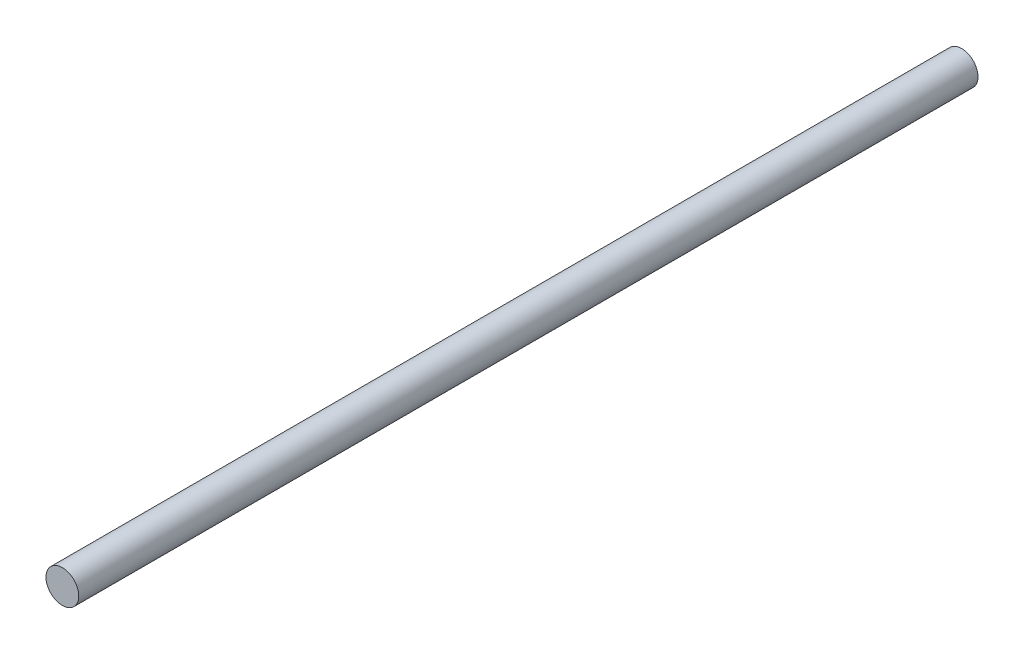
ISO-10303-21;
HEADER;
FILE_DESCRIPTION(('STEP AP214'),'2;1');
FILE_NAME('part.step','',(''),(''),'','','');
FILE_SCHEMA(('AUTOMOTIVE_DESIGN { 1 0 10303 214 1 1 1 1 }'));
ENDSEC;
DATA;
#1=APPLICATION_CONTEXT('core data for automotive mechanical design processes');
#2=APPLICATION_PROTOCOL_DEFINITION('international standard','automotive_design',2000,#1);
#3=PRODUCT_CONTEXT('',#1,'mechanical');
#4=PRODUCT('Part','Part','',(#3));
#5=PRODUCT_RELATED_PRODUCT_CATEGORY('part','',(#4));
#6=PRODUCT_DEFINITION_FORMATION('','',#4);
#7=PRODUCT_DEFINITION_CONTEXT('part definition',#1,'design');
#8=PRODUCT_DEFINITION('design','',#6,#7);
#9=PRODUCT_DEFINITION_SHAPE('','',#8);
#10=(LENGTH_UNIT() NAMED_UNIT(*) SI_UNIT(.MILLI.,.METRE.));
#11=(NAMED_UNIT(*) PLANE_ANGLE_UNIT() SI_UNIT($,.RADIAN.));
#12=(NAMED_UNIT(*) SI_UNIT($,.STERADIAN.) SOLID_ANGLE_UNIT());
#13=UNCERTAINTY_MEASURE_WITH_UNIT(LENGTH_MEASURE(1.E-05),#10,'distance_accuracy_value','');
#14=(GEOMETRIC_REPRESENTATION_CONTEXT(3) GLOBAL_UNCERTAINTY_ASSIGNED_CONTEXT((#13)) GLOBAL_UNIT_ASSIGNED_CONTEXT((#10,
#11,#12)) REPRESENTATION_CONTEXT('',''));
#15=CARTESIAN_POINT('',(0.,0.,0.));
#16=DIRECTION('',(0.,0.,1.));
#17=DIRECTION('',(1.,0.,0.));
#18=AXIS2_PLACEMENT_3D('',#15,#16,#17);
#19=CARTESIAN_POINT('',(0.,0.,0.));
#20=DIRECTION('',(0.,0.,1.));
#21=DIRECTION('',(1.,0.,0.));
#22=AXIS2_PLACEMENT_3D('',#19,#20,#21);
#23=CYLINDRICAL_SURFACE('',#22,1.55);
#24=CARTESIAN_POINT('',(0.,0.,0.));
#25=DIRECTION('',(0.,0.,1.));
#26=DIRECTION('',(1.,0.,0.));
#27=AXIS2_PLACEMENT_3D('',#24,#25,#26);
#28=CIRCLE('',#27,1.55);
#29=CARTESIAN_POINT('',(1.55,0.,0.));
#30=VERTEX_POINT('',#29);
#31=EDGE_CURVE('E10',#30,#30,#28,.T.);
#32=ORIENTED_EDGE('',*,*,#31,.T.);
#33=EDGE_LOOP('',(#32));
#34=FACE_BOUND('',#33,.T.);
#35=CARTESIAN_POINT('',(0.,0.,85.));
#36=DIRECTION('',(0.,0.,1.));
#37=DIRECTION('',(1.,0.,0.));
#38=AXIS2_PLACEMENT_3D('',#35,#36,#37);
#39=CIRCLE('',#38,1.55);
#40=CARTESIAN_POINT('',(1.55,0.,85.));
#41=VERTEX_POINT('',#40);
#42=EDGE_CURVE('E35',#41,#41,#39,.T.);
#43=ORIENTED_EDGE('',*,*,#42,.F.);
#44=EDGE_LOOP('',(#43));
#45=FACE_BOUND('',#44,.T.);
#46=ADVANCED_FACE('F31',(#34,#45),#23,.T.);
#47=CARTESIAN_POINT('',(-1.502126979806,-1.502126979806,85.));
#48=DIRECTION('',(0.,0.,1.));
#49=DIRECTION('',(1.,0.,0.));
#50=AXIS2_PLACEMENT_3D('',#47,#48,#49);
#51=PLANE('',#50);
#52=ORIENTED_EDGE('',*,*,#42,.T.);
#53=EDGE_LOOP('',(#52));
#54=FACE_BOUND('',#53,.T.);
#55=ADVANCED_FACE('F33',(#54),#51,.T.);
#56=CARTESIAN_POINT('',(-1.502126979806,-1.502126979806,0.));
#57=DIRECTION('',(0.,0.,1.));
#58=DIRECTION('',(1.,0.,0.));
#59=AXIS2_PLACEMENT_3D('',#56,#57,#58);
#60=PLANE('',#59);
#61=ORIENTED_EDGE('',*,*,#31,.F.);
#62=EDGE_LOOP('',(#61));
#63=FACE_BOUND('',#62,.T.);
#64=ADVANCED_FACE('F50',(#63),#60,.F.);
#65=CLOSED_SHELL('',(#46,#55,#64));
#66=MANIFOLD_SOLID_BREP('B2',#65);
#67=ADVANCED_BREP_SHAPE_REPRESENTATION('',(#18,#66),#14);
#68=SHAPE_DEFINITION_REPRESENTATION(#9,#67);
ENDSEC;
END-ISO-10303-21;
